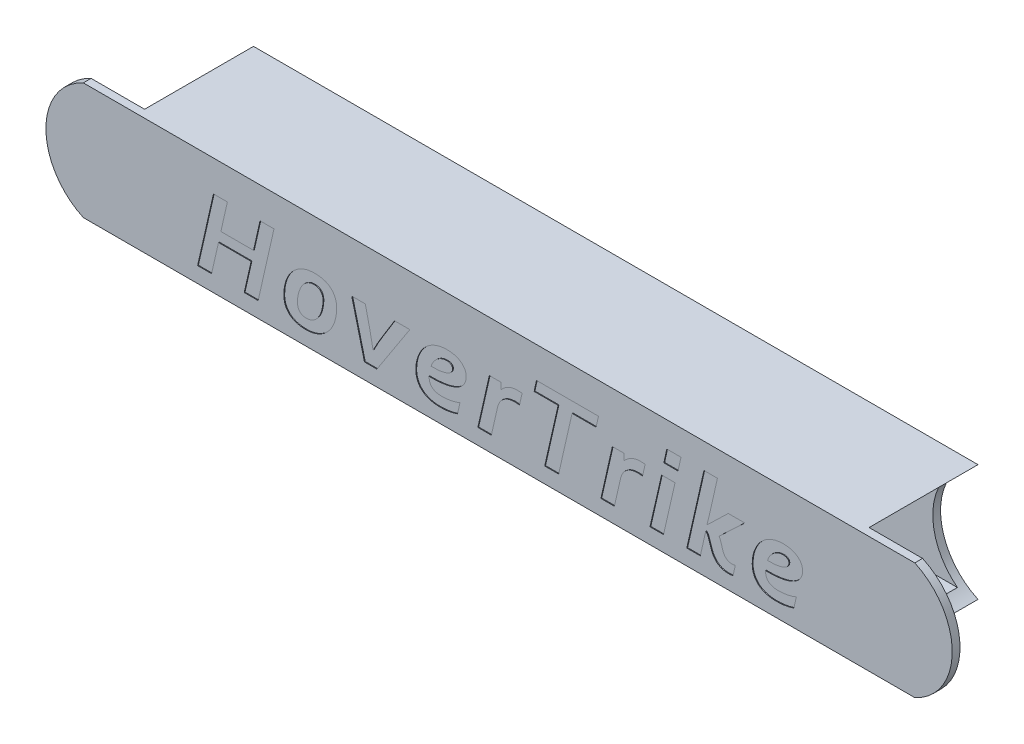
from build123d import *

# Parameters (mm, degrees)
ESQUISSE1_W             = 30
ESQUISSE1_H             = 30
ESQUISSE1_W_2           = 26
ESQUISSE1_H_2           = 26
BOSS_EXTRU_1_DEPTH      = 116.5
ENL_V_MAT_EXTRU_2_DEPTH = 124.98487811
ESQUISSE2_R             = 16.5
ENL_V_MAT_EXTRU_3_DEPTH = 28
ENL_V_MAT_EXTRU_4_DEPTH = 0.2


with BuildPart() as part:
    # Esquisse1 → Boss.-Extru.1 (new body)
    with BuildSketch(Plane(origin=(0, 0, 0), x_dir=(0, 0, -1), z_dir=(1, 0, 0))):
        with Locations((15, -15)):
            Rectangle(ESQUISSE1_W, ESQUISSE1_H)
        with Locations((15, -15)):
            Rectangle(ESQUISSE1_W_2, ESQUISSE1_H_2, mode=Mode.SUBTRACT)
    boss_extru_1 = extrude(amount=BOSS_EXTRU_1_DEPTH)

    # Esquisse3 → Enl_v. mat.-Extru.2 (cut, through all)
    with BuildSketch(Plane(origin=(0, 0, -30), x_dir=(-1, 0, 0), z_dir=(0, 0, -1))):
        with BuildLine():
            Line((-106.873863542, 0), (-116.5, 0))
            Line((-116.5, 0), (-126.126136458, 0))
            Line((-126.126136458, 0), (-126.126136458, -30))
            Line((-126.126136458, -30), (-116.5, -30))
            Line((-116.5, -30), (-106.873863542, -30))
            ThreePointArc((-106.873863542, -30), (-116.5, -15), (-106.873863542, 0))
        make_face()
    enl_v_mat_extru_2 = extrude(amount=-ENL_V_MAT_EXTRU_2_DEPTH, mode=Mode.SUBTRACT)

    # Esquisse2 → Enl_v. mat.-Extru.3 (cut)
    with BuildSketch(Plane(origin=(0, 0, -30), x_dir=(-1, 0, 0), z_dir=(0, 0, -1))):
        with Locations((-100, -15)):
            Circle(ESQUISSE2_R)
    enl_v_mat_extru_3 = extrude(amount=-ENL_V_MAT_EXTRU_3_DEPTH, mode=Mode.SUBTRACT)

    # Sym_trie1: Boss.-Extru.1, Enl_v. mat.-Extru.2, Enl_v. mat.-Extru.3 across plane
    add(boss_extru_1.mirror(Plane(origin=(0, 0, 0), x_dir=(0, 0, 1), z_dir=(1, 0, 0))))
    add(enl_v_mat_extru_2.mirror(Plane(origin=(0, 0, 0), x_dir=(0, 0, 1), z_dir=(1, 0, 0))), mode=Mode.SUBTRACT)
    add(enl_v_mat_extru_3.mirror(Plane(origin=(0, 0, 0), x_dir=(0, 0, 1), z_dir=(1, 0, 0))), mode=Mode.SUBTRACT)

    # Esquisse4 → Enl_v. mat.-Extru.4 (cut)
    # profile 1 of 11: a face of its own
    with BuildSketch(Plane.XY):
        Polygon((-71.513728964, -15.41364039), (-63.119574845, -15.41364039), (-61.445527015, -8), (-57.858281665, -8), (-61.931798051, -26), (-65.515057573, -26), (-63.737378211, -18.171833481), (-72.131532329, -18.171833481), (-73.909211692, -26), (-77.496457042, -26), (-73.422940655, -8), (-69.839681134, -8), align=None)
    # profile 2 of 11: a face of its own
    with BuildSketch(Plane.XY):
        with BuildLine():
            add(Edge.make_bspline(
                [(-47.307794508, -12.643489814), (-47.101761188, -12.647628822), (-46.699546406, -12.655708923), (-46.111356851, -12.709542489), (-45.555037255, -12.811226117), (-45.028430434, -12.945745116), (-44.53318254, -13.114646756), (-44.074907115, -13.327149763), (-43.655232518, -13.579855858), (-43.268742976, -13.866350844), (-42.925815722, -14.196175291), (-42.616155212, -14.561040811), (-42.360616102, -14.975039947), (-42.138885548, -15.42379312), (-41.962701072, -15.911256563), (-41.841364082, -16.438520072), (-41.762986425, -17.002957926), (-41.755438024, -17.39299219), (-41.751550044, -17.593888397)],
                knots=[0, 0, 0, 0, 1.169669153, 2.283408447, 3.348613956, 4.376697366, 5.366583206, 6.31478931, 7.23834747, 8.143426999, 9.039663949, 9.933899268, 10.852516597, 11.793616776, 12.77179613, 13.787129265, 14.860209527, 16, 16, 16, 16], degree=3))
            add(Edge.make_bspline(
                [(-41.751550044, -17.593888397), (-41.757670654, -17.878459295), (-41.769803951, -18.442583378), (-41.86723577, -19.280142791), (-42.033221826, -20.098619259), (-42.252482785, -20.897322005), (-42.538958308, -21.663825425), (-42.890344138, -22.386931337), (-43.303197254, -23.065585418), (-43.7770505, -23.695634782), (-44.311565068, -24.272968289), (-44.912497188, -24.786302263), (-45.572106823, -25.243186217), (-46.294515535, -25.63314324), (-47.075353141, -25.953447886), (-47.919915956, -26.172683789), (-48.821708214, -26.312736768), (-49.443652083, -26.327320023), (-49.763064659, -26.334809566)],
                knots=[0, 0, 0, 0, 1.026074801, 2.034057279, 3.03574541, 4.035495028, 5.0179998, 5.982309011, 6.930593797, 7.878333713, 8.820814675, 9.761991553, 10.7229142, 11.709115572, 12.717200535, 13.758554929, 14.848857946, 16, 16, 16, 16], degree=3))
            add(Edge.make_bspline(
                [(-49.763064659, -26.334809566), (-49.966467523, -26.330804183), (-50.364753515, -26.322961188), (-50.949644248, -26.266684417), (-51.506948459, -26.17252294), (-52.035277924, -26.037403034), (-52.530052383, -25.862190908), (-52.990584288, -25.650539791), (-53.41631003, -25.404288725), (-53.801292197, -25.115096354), (-54.147409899, -24.787771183), (-54.44576315, -24.41577366), (-54.713852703, -24.011840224), (-54.931149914, -23.561920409), (-55.108359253, -23.075168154), (-55.22986034, -22.54643775), (-55.307809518, -21.979308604), (-55.31540009, -21.586633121), (-55.319309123, -21.384410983)],
                knots=[0, 0, 0, 0, 1.154380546, 2.260408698, 3.331541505, 4.35943624, 5.351636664, 6.30651211, 7.232545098, 8.137458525, 9.033530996, 9.928619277, 10.838452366, 11.779379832, 12.757379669, 13.772526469, 14.852883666, 16, 16, 16, 16], degree=3))
            add(Edge.make_bspline(
                [(-55.319309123, -21.384410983), (-55.313193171, -21.099839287), (-55.301069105, -20.535713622), (-55.203569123, -19.698165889), (-55.038093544, -18.880900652), (-54.817897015, -18.081913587), (-54.527913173, -17.316316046), (-54.176777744, -16.591245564), (-53.764385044, -15.914500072), (-53.292925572, -15.284940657), (-52.757590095, -14.708470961), (-52.157345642, -14.192312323), (-51.494037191, -13.741046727), (-50.775886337, -13.347499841), (-49.99357002, -13.02946), (-49.150130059, -12.805299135), (-48.247789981, -12.665554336), (-47.627191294, -12.650987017), (-47.307794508, -12.643489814)],
                knots=[0, 0, 0, 0, 1.026343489, 2.034589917, 3.03654035, 4.031935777, 5.020872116, 5.985433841, 6.933966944, 7.875243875, 8.817971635, 9.766153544, 10.724611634, 11.706859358, 12.715208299, 13.762706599, 14.848556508, 16, 16, 16, 16], degree=3))
        make_face()
        with BuildLine():
            add(Edge.make_bspline(
                [(-47.602745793, -15.250221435), (-47.718474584, -15.253282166), (-47.945641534, -15.259290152), (-48.279042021, -15.306678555), (-48.5956764, -15.393098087), (-48.998017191, -15.53996309), (-49.468956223, -15.796988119), (-49.969609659, -16.205932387), (-50.408723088, -16.697029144), (-50.786694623, -17.25628838), (-51.098150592, -17.874452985), (-51.359877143, -18.529618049), (-51.567700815, -19.214955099), (-51.711885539, -19.915554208), (-51.804145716, -20.618001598), (-51.814581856, -21.085199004), (-51.819751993, -21.316651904)],
                knots=[0, 0, 0, 0, 0.594782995, 1.167514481, 1.725771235, 2.278908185, 3.366816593, 4.464328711, 5.586176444, 6.741632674, 7.923666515, 9.137317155, 10.364477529, 11.599404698, 12.810728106, 14, 14, 14, 14], degree=3))
            add(Edge.make_bspline(
                [(-51.819751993, -21.316651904), (-51.813788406, -21.494032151), (-51.802409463, -21.832486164), (-51.691447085, -22.31055396), (-51.518793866, -22.733216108), (-51.266336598, -23.093244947), (-50.936196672, -23.387983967), (-50.51366369, -23.584186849), (-50.01754985, -23.711102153), (-49.659014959, -23.72217971), (-49.468113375, -23.728077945)],
                knots=[0, 0, 0, 0, 1.104585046, 2.107626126, 3.043343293, 3.935332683, 4.827860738, 5.769138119, 6.812179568, 8, 8, 8, 8], degree=3))
            add(Edge.make_bspline(
                [(-49.468113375, -23.728077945), (-49.352348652, -23.725151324), (-49.125111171, -23.719406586), (-48.792551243, -23.670164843), (-48.475573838, -23.591150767), (-48.074484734, -23.439599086), (-47.603261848, -23.18257466), (-47.101317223, -22.771110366), (-46.658606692, -22.283447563), (-46.280881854, -21.723050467), (-45.958656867, -21.110823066), (-45.702029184, -20.451693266), (-45.503672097, -19.762532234), (-45.364262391, -19.055455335), (-45.265886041, -18.348607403), (-45.25597448, -17.877199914), (-45.251107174, -17.645704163)],
                knots=[0, 0, 0, 0, 0.593382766, 1.164765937, 1.719997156, 2.265443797, 3.360032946, 4.454961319, 5.578741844, 6.725846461, 7.911379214, 9.119658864, 10.346600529, 11.583921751, 12.81352787, 14, 14, 14, 14], degree=3))
            add(Edge.make_bspline(
                [(-45.251107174, -17.645704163), (-45.257272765, -17.471033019), (-45.269076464, -17.136634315), (-45.378316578, -16.662634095), (-45.557402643, -16.243888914), (-45.812341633, -15.885750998), (-46.143535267, -15.591133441), (-46.562293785, -15.388768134), (-47.058049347, -15.268843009), (-47.413335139, -15.25669683), (-47.602745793, -15.250221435)],
                knots=[0, 0, 0, 0, 1.093353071, 2.093166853, 3.029083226, 3.930240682, 4.827117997, 5.776676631, 6.814697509, 8, 8, 8, 8], degree=3))
        make_face(mode=Mode.SUBTRACT)
    # profile 3 of 11: a face of its own
    with BuildSketch(Plane.XY):
        with BuildLine():
            Line((-34.381753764, -12.966341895), (-33.249778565, -17.928697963))
            add(Edge.make_bspline(
                [(-33.249778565, -17.928697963), (-33.161901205, -18.311006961), (-32.990723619, -19.055712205), (-32.766234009, -20.147474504), (-32.562908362, -21.18029541), (-32.451070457, -21.851803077), (-32.396811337, -22.177590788)],
                knots=[0, 0, 0, 0, 1.085988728, 2.115413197, 3.085676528, 4, 4, 4, 4], degree=3))
            Line((-32.396811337, -22.177590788), (-32.309123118, -22.177590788))
            add(Edge.make_bspline(
                [(-32.309123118, -22.177590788), (-32.13052583, -21.824407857), (-31.772143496, -21.115693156), (-31.195789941, -20.071048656), (-30.599267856, -19.031484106), (-30.179813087, -18.35013481), (-29.969441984, -18.008414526)],
                knots=[0, 0, 0, 0, 0.992965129, 1.99253396, 2.993186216, 4, 4, 4, 4], degree=3))
            Line((-29.969441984, -18.008414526), (-26.856510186, -12.966341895))
            Line((-26.856510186, -12.966341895), (-22.930469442, -12.966341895))
            Line((-22.930469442, -12.966341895), (-31.41231178, -26))
            Line((-31.41231178, -26), (-34.600974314, -26))
            Line((-34.600974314, -26), (-37.877325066, -12.966341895))
            Line((-37.877325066, -12.966341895), (-34.381753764, -12.966341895))
        make_face()
    # profile 4 of 11: a face of its own
    with BuildSketch(Plane.XY):
        with BuildLine():
            add(Edge.make_bspline(
                [(-8.441984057, -16.206820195), (-8.448621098, -16.384089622), (-8.461673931, -16.732719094), (-8.573122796, -17.242489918), (-8.756718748, -17.723933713), (-9.017108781, -18.174258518), (-9.342240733, -18.597073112), (-9.741810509, -18.984170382), (-10.208157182, -19.339695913), (-10.741195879, -19.662883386), (-11.342716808, -19.948926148), (-12.011175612, -20.199131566), (-12.745783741, -20.412074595), (-13.544240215, -20.591711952), (-14.405961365, -20.727590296), (-15.329948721, -20.832973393), (-16.317228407, -20.891021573), (-16.996828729, -20.898354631), (-17.346324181, -20.902125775)],
                knots=[0, 0, 0, 0, 0.762492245, 1.499566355, 2.234662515, 2.972513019, 3.731047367, 4.523832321, 5.360138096, 6.25087119, 7.202584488, 8.223526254, 9.320384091, 10.492972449, 11.744594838, 13.07424482, 14.4953831, 16, 16, 16, 16], degree=3))
            add(Edge.make_bspline(
                [(-17.346324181, -20.902125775), (-17.440665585, -20.90121807), (-17.651993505, -20.899184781), (-17.863168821, -20.890815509), (-17.980070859, -20.886182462)],
                knots=[0, 0, 0, 0, 0.892843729, 2, 2, 2, 2], degree=3))
            Line((-17.980070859, -20.886182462), (-17.980070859, -20.969884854))
            add(Edge.make_bspline(
                [(-17.980070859, -20.969884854), (-17.976539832, -21.085573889), (-17.96974007, -21.308358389), (-17.9306934, -21.633259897), (-17.859679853, -21.933971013), (-17.760191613, -22.212751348), (-17.629864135, -22.465058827), (-17.481093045, -22.699049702), (-17.296805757, -22.902608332), (-17.095175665, -23.088111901), (-16.862650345, -23.244537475), (-16.60957322, -23.377888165), (-16.33405008, -23.492656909), (-15.926655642, -23.607841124), (-15.365925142, -23.707292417), (-14.902196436, -23.720944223), (-14.659875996, -23.728077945)],
                knots=[0, 0, 0, 0, 0.984919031, 1.896676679, 2.77993483, 3.609892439, 4.408996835, 5.193157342, 5.962333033, 6.739037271, 7.520092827, 8.33966102, 9.171311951, 10.055221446, 11.938664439, 14, 14, 14, 14], degree=3))
            add(Edge.make_bspline(
                [(-14.659875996, -23.728077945), (-14.46580435, -23.724941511), (-14.073106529, -23.718595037), (-13.477149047, -23.668214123), (-12.866703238, -23.588308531), (-12.250767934, -23.478495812), (-11.646541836, -23.341205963), (-11.074674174, -23.178268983), (-10.541344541, -22.996929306), (-10.206888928, -22.853276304), (-10.04428698, -22.78343667)],
                knots=[0, 0, 0, 0, 0.981983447, 1.987012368, 3.024442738, 4.096670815, 5.151921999, 6.158568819, 7.104753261, 8, 8, 8, 8], degree=3))
            Line((-10.04428698, -22.78343667), (-10.67404783, -25.581488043))
            add(Edge.make_bspline(
                [(-10.67404783, -25.581488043), (-10.83038373, -25.635971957), (-11.152697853, -25.748300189), (-11.656496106, -25.894630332), (-12.194220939, -26.02185095), (-12.760617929, -26.132184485), (-13.353162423, -26.225710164), (-13.966692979, -26.286624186), (-14.599477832, -26.329504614), (-15.027824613, -26.333020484), (-15.245792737, -26.334809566)],
                knots=[0, 0, 0, 0, 0.853176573, 1.758974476, 2.702351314, 3.700149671, 4.732523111, 5.792726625, 6.87680903, 8, 8, 8, 8], degree=3))
            add(Edge.make_bspline(
                [(-15.245792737, -26.334809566), (-15.499710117, -26.330393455), (-15.991352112, -26.321842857), (-16.703573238, -26.251278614), (-17.362810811, -26.126702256), (-17.972690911, -25.962341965), (-18.529438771, -25.74488433), (-19.036698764, -25.490215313), (-19.497400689, -25.199704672), (-19.901311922, -24.86139143), (-20.25726571, -24.489103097), (-20.568928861, -24.085006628), (-20.821145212, -23.642295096), (-21.037226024, -23.174691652), (-21.192569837, -22.673775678), (-21.30980987, -22.150200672), (-21.377637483, -21.601416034), (-21.387115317, -21.227815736), (-21.39193977, -21.037643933)],
                knots=[0, 0, 0, 0, 1.322631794, 2.560916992, 3.722922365, 4.814392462, 5.846510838, 6.830829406, 7.767772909, 8.677003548, 9.567952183, 10.446992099, 11.327828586, 12.216839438, 13.125226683, 14.053876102, 15.009374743, 16, 16, 16, 16], degree=3))
            add(Edge.make_bspline(
                [(-21.39193977, -21.037643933), (-21.380158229, -20.692806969), (-21.356535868, -20.001398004), (-21.203903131, -19.146557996), (-21.031013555, -18.474365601), (-20.868757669, -17.979370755), (-20.68920285, -17.492360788), (-20.471127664, -17.021317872), (-20.227781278, -16.56220335), (-19.959354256, -16.117773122), (-19.660111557, -15.692260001), (-19.340480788, -15.281808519), (-18.987909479, -14.895112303), (-18.611206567, -14.530772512), (-18.200949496, -14.201165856), (-17.7702304, -13.892279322), (-17.312399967, -13.61151557), (-16.823183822, -13.37094829), (-16.3119639, -13.1532299), (-15.773745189, -12.971094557), (-15.210001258, -12.820579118), (-14.620135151, -12.720761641), (-14.007772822, -12.653167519), (-13.591864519, -12.646751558), (-13.380425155, -12.643489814)],
                knots=[0, 0, 0, 0, 1.755336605, 3.519505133, 4.407325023, 5.288883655, 6.171065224, 7.049085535, 7.929864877, 8.816394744, 9.691071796, 10.5776533, 11.463795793, 12.353881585, 13.243633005, 14.141068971, 15.051972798, 15.974859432, 16.914825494, 17.879808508, 18.866117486, 19.882823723, 20.923670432, 22, 22, 22, 22], degree=3))
            add(Edge.make_bspline(
                [(-13.380425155, -12.643489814), (-13.195631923, -12.646327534), (-12.836024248, -12.651849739), (-12.310134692, -12.701255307), (-11.812925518, -12.77876141), (-11.344459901, -12.891657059), (-10.905598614, -13.029963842), (-10.497998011, -13.196250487), (-10.126140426, -13.392071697), (-9.788659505, -13.6126183), (-9.484676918, -13.855773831), (-9.213392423, -14.122800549), (-8.988235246, -14.421840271), (-8.788874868, -14.736554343), (-8.63457289, -15.075950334), (-8.519681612, -15.435253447), (-8.457599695, -15.815395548), (-8.447239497, -16.075086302), (-8.441984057, -16.206820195)],
                knots=[0, 0, 0, 0, 1.301366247, 2.532459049, 3.717147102, 4.843006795, 5.923292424, 6.955613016, 7.939366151, 8.878995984, 9.791003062, 10.677739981, 11.551893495, 12.421879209, 13.297084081, 14.170235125, 15.071811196, 16, 16, 16, 16], degree=3))
        make_face()
        with BuildLine():
            add(Edge.make_bspline(
                [(-11.937555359, -16.206820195), (-11.941962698, -16.134441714), (-11.950680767, -15.991271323), (-12.027072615, -15.786179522), (-12.15056258, -15.599492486), (-12.319770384, -15.43051371), (-12.540132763, -15.289021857), (-12.810998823, -15.186330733), (-13.132198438, -15.128296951), (-13.361575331, -15.122033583), (-13.484056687, -15.118689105)],
                knots=[0, 0, 0, 0, 0.819253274, 1.62054813, 2.448634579, 3.344255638, 4.314570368, 5.39823568, 6.610724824, 8, 8, 8, 8], degree=3))
            add(Edge.make_bspline(
                [(-13.484056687, -15.118689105), (-13.681733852, -15.128728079), (-14.088880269, -15.149404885), (-14.691863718, -15.321979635), (-15.284756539, -15.588626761), (-15.845087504, -15.961258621), (-16.354562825, -16.43893153), (-16.72748065, -16.907675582), (-16.998426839, -17.322149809), (-17.176294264, -17.663814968), (-17.338309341, -18.026145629), (-17.422897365, -18.281281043), (-17.465899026, -18.410983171)],
                knots=[0, 0, 0, 0, 1.073178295, 2.210375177, 3.383881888, 4.597949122, 5.850182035, 7.165553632, 7.844782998, 8.539506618, 9.257535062, 10, 10, 10, 10], degree=3))
            add(Edge.make_bspline(
                [(-17.465899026, -18.410983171), (-17.216053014, -18.409086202), (-16.737340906, -18.405451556), (-16.051568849, -18.36722908), (-15.428165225, -18.317205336), (-14.866698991, -18.228837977), (-14.359586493, -18.134606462), (-13.908255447, -18.009859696), (-13.503651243, -17.889459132), (-13.154609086, -17.739097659), (-12.852777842, -17.579872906), (-12.595198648, -17.410252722), (-12.38558951, -17.225417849), (-12.218863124, -17.032326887), (-12.093723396, -16.83109616), (-12.006158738, -16.625117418), (-11.94510833, -16.417572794), (-11.940045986, -16.276316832), (-11.937555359, -16.206820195)],
                knots=[0, 0, 0, 0, 1.856650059, 3.557394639, 5.104013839, 6.501915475, 7.780048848, 8.934525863, 9.98071473, 10.914263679, 11.753599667, 12.514964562, 13.200516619, 13.823865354, 14.404787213, 14.953246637, 15.485006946, 16, 16, 16, 16], degree=3))
        make_face(mode=Mode.SUBTRACT)
    # profile 5 of 11: a face of its own
    with BuildSketch(Plane.XY):
        with BuildLine():
            add(Edge.make_bspline(
                [(5.249335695, -15.69663419), (5.042729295, -15.656101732), (4.63988738, -15.577071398), (4.229556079, -15.566342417), (4.029672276, -15.561116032)],
                knots=[0, 0, 0, 0, 1.025744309, 2, 2, 2, 2], degree=3))
            add(Edge.make_bspline(
                [(4.029672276, -15.561116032), (3.851375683, -15.567031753), (3.490424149, -15.579007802), (2.950326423, -15.659919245), (2.411879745, -15.797191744), (1.889887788, -16.010269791), (1.38534902, -16.291783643), (0.908921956, -16.648893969), (0.476773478, -17.101302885), (0.251624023, -17.460481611), (0.135518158, -17.645704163)],
                knots=[0, 0, 0, 0, 0.923546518, 1.869668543, 2.822898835, 3.795536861, 4.781597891, 5.808513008, 6.869886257, 8, 8, 8, 8], degree=3))
            add(Edge.make_bspline(
                [(0.135518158, -17.645704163), (0.08104032, -17.748665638), (-0.036925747, -17.971617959), (-0.16654741, -18.275233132), (-0.264217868, -18.562534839), (-0.344255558, -18.821282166), (-0.423373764, -19.120593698), (-0.472317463, -19.334209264), (-0.498228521, -19.447298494)],
                knots=[0, 0, 0, 0, 1.093556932, 2.367983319, 3.093907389, 3.94231311, 4.910649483, 6, 6, 6, 6], degree=3))
            Line((-0.498228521, -19.447298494), (-1.980956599, -26))
            Line((-1.980956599, -26), (-5.452612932, -26))
            Line((-5.452612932, -26), (-2.495128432, -12.966341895))
            Line((-2.495128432, -12.966341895), (0.458370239, -12.966341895))
            Line((0.458370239, -12.966341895), (0.458370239, -14.604517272))
            Line((0.458370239, -14.604517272), (0.518157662, -14.604517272))
            add(Edge.make_bspline(
                [(0.518157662, -14.604517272), (0.658952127, -14.455595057), (0.936455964, -14.162071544), (1.394298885, -13.774977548), (1.874236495, -13.43818751), (2.380787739, -13.15052019), (2.922663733, -12.920793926), (3.507398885, -12.756317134), (4.136781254, -12.660764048), (4.571411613, -12.649356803), (4.794951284, -12.643489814)],
                knots=[0, 0, 0, 0, 1.011534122, 1.993718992, 2.95487779, 3.90388708, 4.865448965, 5.854209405, 6.896374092, 8, 8, 8, 8], degree=3))
            add(Edge.make_bspline(
                [(4.794951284, -12.643489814), (4.97983831, -12.647112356), (5.358497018, -12.654531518), (5.734509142, -12.699959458), (5.926926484, -12.723206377)],
                knots=[0, 0, 0, 0, 0.976536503, 2, 2, 2, 2], degree=3))
            Line((5.926926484, -12.723206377), (5.249335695, -15.69663419))
        make_face()
    # profile 6 of 11: a face of its own
    with BuildSketch(Plane.XY):
        Polygon((15.317537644, -26), (11.734278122, -26), (15.186005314, -10.758193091), (9.011957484, -10.758193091), (9.617803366, -8), (25.561116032, -8), (24.947298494, -10.758193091), (18.773250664, -10.758193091), align=None)
    # profile 7 of 11: a face of its own
    with BuildSketch(Plane.XY):
        with BuildLine():
            add(Edge.make_bspline(
                [(36.880868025, -15.69663419), (36.674261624, -15.656101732), (36.271419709, -15.577071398), (35.861088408, -15.566342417), (35.661204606, -15.561116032)],
                knots=[0, 0, 0, 0, 1.025744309, 2, 2, 2, 2], degree=3))
            add(Edge.make_bspline(
                [(35.661204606, -15.561116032), (35.482908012, -15.567031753), (35.121956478, -15.579007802), (34.581858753, -15.659919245), (34.043412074, -15.797191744), (33.521420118, -16.010269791), (33.016881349, -16.291783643), (32.540454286, -16.648893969), (32.108305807, -17.101302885), (31.883156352, -17.460481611), (31.767050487, -17.645704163)],
                knots=[0, 0, 0, 0, 0.923546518, 1.869668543, 2.822898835, 3.795536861, 4.781597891, 5.808513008, 6.869886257, 8, 8, 8, 8], degree=3))
            add(Edge.make_bspline(
                [(31.767050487, -17.645704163), (31.71257265, -17.748665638), (31.594606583, -17.971617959), (31.46498492, -18.275233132), (31.367314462, -18.562534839), (31.287276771, -18.821282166), (31.208158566, -19.120593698), (31.159214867, -19.334209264), (31.133303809, -19.447298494)],
                knots=[0, 0, 0, 0, 1.093556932, 2.367983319, 3.093907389, 3.94231311, 4.910649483, 6, 6, 6, 6], degree=3))
            Line((31.133303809, -19.447298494), (29.650575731, -26))
            Line((29.650575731, -26), (26.178919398, -26))
            Line((26.178919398, -26), (29.136403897, -12.966341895))
            Line((29.136403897, -12.966341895), (32.089902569, -12.966341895))
            Line((32.089902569, -12.966341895), (32.089902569, -14.604517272))
            Line((32.089902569, -14.604517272), (32.149689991, -14.604517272))
            add(Edge.make_bspline(
                [(32.149689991, -14.604517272), (32.290484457, -14.455595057), (32.567988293, -14.162071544), (33.025831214, -13.774977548), (33.505768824, -13.43818751), (34.012320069, -13.15052019), (34.554196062, -12.920793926), (35.138931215, -12.756317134), (35.768313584, -12.660764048), (36.202943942, -12.649356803), (36.426483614, -12.643489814)],
                knots=[0, 0, 0, 0, 1.011534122, 1.993718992, 2.95487779, 3.90388708, 4.865448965, 5.854209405, 6.896374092, 8, 8, 8, 8], degree=3))
            add(Edge.make_bspline(
                [(36.426483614, -12.643489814), (36.611370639, -12.647112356), (36.990029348, -12.654531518), (37.366041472, -12.699959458), (37.558458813, -12.723206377)],
                knots=[0, 0, 0, 0, 0.976536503, 2, 2, 2, 2], degree=3))
            Line((37.558458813, -12.723206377), (36.880868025, -15.69663419))
        make_face()
    # profile 8 of 11: a face of its own
    with BuildSketch(Plane.XY):
        Polygon((42.365367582, -9.976970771), (43.13064659, -6.52125775), (46.773693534, -6.52125775), (46.008414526, -9.976970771), align=None)
    # profile 9 of 11: a face of its own
    with BuildSketch(Plane.XY):
        Polygon((38.806023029, -26), (41.775465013, -12.966341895), (45.247121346, -12.966341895), (42.277679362, -26), align=None)
    # profile 10 of 11: a face of its own
    with BuildSketch(Plane.XY):
        with BuildLine():
            Line((51.736049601, -26), (48.264393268, -26))
            Line((48.264393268, -26), (52.676705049, -6.52125775))
            Line((52.676705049, -6.52125775), (56.144375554, -6.52125775))
            Line((56.144375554, -6.52125775), (53.984056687, -16.08724535))
            add(Edge.make_bspline(
                [(53.984056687, -16.08724535), (53.943403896, -16.2600957), (53.860403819, -16.613001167), (53.726243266, -17.138496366), (53.594112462, -17.656251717), (53.499740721, -17.99263925), (53.453941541, -18.155890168)],
                knots=[0, 0, 0, 0, 0.997697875, 2.036981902, 3.047335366, 4, 4, 4, 4], degree=3))
            Line((53.453941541, -18.155890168), (53.557573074, -18.155890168))
            Line((53.557573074, -18.155890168), (58.922497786, -12.966341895))
            Line((58.922497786, -12.966341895), (63.167404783, -12.966341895))
            Line((63.167404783, -12.966341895), (56.582816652, -19.192205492))
            Line((56.582816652, -19.192205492), (56.582816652, -19.248007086))
            add(Edge.make_bspline(
                [(56.582816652, -19.248007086), (56.654178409, -19.349051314), (56.80893162, -19.56817314), (56.944549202, -19.975150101), (57.077705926, -20.42487576), (57.207822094, -20.907558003), (57.355923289, -21.405069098), (57.514392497, -21.905501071), (57.716482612, -22.384320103), (57.979815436, -22.818643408), (58.314658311, -23.191111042), (58.652303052, -23.443424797), (58.965409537, -23.593838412), (59.234736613, -23.671347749), (59.531896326, -23.71997112), (59.739387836, -23.725305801), (59.84720992, -23.728077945)],
                knots=[0, 0, 0, 0, 0.860393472, 1.865826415, 2.970569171, 4.146696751, 5.35729505, 6.599501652, 7.814011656, 8.981491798, 10.132156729, 11.294899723, 11.901373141, 12.550698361, 13.246876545, 14, 14, 14, 14], degree=3))
            add(Edge.make_bspline(
                [(59.84720992, -23.728077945), (59.981742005, -23.721687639), (60.277931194, -23.707618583), (60.569139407, -23.65123447), (60.728077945, -23.620460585)],
                knots=[0, 0, 0, 0, 0.908419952, 2, 2, 2, 2], degree=3))
            Line((60.728077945, -23.620460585), (60.142161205, -26.243135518))
            add(Edge.make_bspline(
                [(60.142161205, -26.243135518), (59.95107478, -26.266379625), (59.580367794, -26.311473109), (59.207026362, -26.319138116), (59.026129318, -26.322852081)],
                knots=[0, 0, 0, 0, 1.030929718, 2, 2, 2, 2], degree=3))
            add(Edge.make_bspline(
                [(59.026129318, -26.322852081), (58.82259834, -26.318986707), (58.431266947, -26.311554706), (57.872791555, -26.235409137), (57.368518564, -26.112697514), (56.917009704, -25.943225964), (56.521291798, -25.718953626), (56.154120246, -25.484249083), (55.830497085, -25.209440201), (55.541492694, -24.910501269), (55.293717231, -24.584941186), (55.065993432, -24.249799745), (54.875566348, -23.893191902), (54.66196918, -23.400009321), (54.439142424, -22.779315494), (54.198102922, -22.052665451), (53.982127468, -21.368143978), (53.797612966, -20.83743999), (53.647167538, -20.453789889), (53.513488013, -20.212568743), (53.367868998, -20.003182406), (53.248702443, -19.891906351), (53.190876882, -19.837909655)],
                knots=[0, 0, 0, 0, 1.281680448, 2.464301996, 3.542318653, 4.546541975, 5.490487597, 6.402878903, 7.288142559, 8.158399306, 9.01735117, 9.862404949, 10.708825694, 11.559581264, 13.246639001, 14.861311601, 16.383396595, 17.767984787, 18.402217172, 18.975402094, 19.502813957, 20, 20, 20, 20], degree=3))
            Line((53.190876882, -19.837909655), (53.13108946, -19.837909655))
            Line((53.13108946, -19.837909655), (51.736049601, -26))
        make_face()
    # profile 11 of 11: a face of its own
    with BuildSketch(Plane.XY):
        with BuildLine():
            add(Edge.make_bspline(
                [(78.034543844, -16.206820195), (78.027906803, -16.384089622), (78.014853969, -16.732719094), (77.903405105, -17.242489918), (77.719809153, -17.723933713), (77.45941912, -18.174258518), (77.134287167, -18.597073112), (76.734717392, -18.984170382), (76.268370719, -19.339695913), (75.735332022, -19.662883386), (75.133811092, -19.948926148), (74.465352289, -20.199131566), (73.73074416, -20.412074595), (72.932287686, -20.591711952), (72.070566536, -20.727590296), (71.14657918, -20.832973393), (70.159299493, -20.891021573), (69.479699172, -20.898354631), (69.13020372, -20.902125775)],
                knots=[0, 0, 0, 0, 0.762492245, 1.499566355, 2.234662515, 2.972513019, 3.731047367, 4.523832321, 5.360138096, 6.25087119, 7.202584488, 8.223526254, 9.320384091, 10.492972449, 11.744594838, 13.07424482, 14.4953831, 16, 16, 16, 16], degree=3))
            add(Edge.make_bspline(
                [(69.13020372, -20.902125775), (69.035862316, -20.90121807), (68.824534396, -20.899184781), (68.613359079, -20.890815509), (68.496457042, -20.886182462)],
                knots=[0, 0, 0, 0, 0.892843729, 2, 2, 2, 2], degree=3))
            Line((68.496457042, -20.886182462), (68.496457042, -20.969884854))
            add(Edge.make_bspline(
                [(68.496457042, -20.969884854), (68.499988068, -21.085573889), (68.506787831, -21.308358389), (68.5458345, -21.633259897), (68.616848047, -21.933971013), (68.716336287, -22.212751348), (68.846663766, -22.465058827), (68.995434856, -22.699049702), (69.179722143, -22.902608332), (69.381352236, -23.088111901), (69.613877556, -23.244537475), (69.866954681, -23.377888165), (70.142477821, -23.492656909), (70.549872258, -23.607841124), (71.110602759, -23.707292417), (71.574331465, -23.720944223), (71.816651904, -23.728077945)],
                knots=[0, 0, 0, 0, 0.984919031, 1.896676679, 2.77993483, 3.609892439, 4.408996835, 5.193157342, 5.962333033, 6.739037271, 7.520092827, 8.33966102, 9.171311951, 10.055221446, 11.938664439, 14, 14, 14, 14], degree=3))
            add(Edge.make_bspline(
                [(71.816651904, -23.728077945), (72.01072355, -23.724941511), (72.403421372, -23.718595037), (72.999378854, -23.668214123), (73.609824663, -23.588308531), (74.225759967, -23.478495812), (74.829986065, -23.341205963), (75.401853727, -23.178268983), (75.93518336, -22.996929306), (76.269638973, -22.853276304), (76.432240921, -22.78343667)],
                knots=[0, 0, 0, 0, 0.981983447, 1.987012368, 3.024442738, 4.096670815, 5.151921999, 6.158568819, 7.104753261, 8, 8, 8, 8], degree=3))
            Line((76.432240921, -22.78343667), (75.802480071, -25.581488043))
            add(Edge.make_bspline(
                [(75.802480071, -25.581488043), (75.646144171, -25.635971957), (75.323830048, -25.748300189), (74.820031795, -25.894630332), (74.282306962, -26.02185095), (73.715909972, -26.132184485), (73.123365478, -26.225710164), (72.509834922, -26.286624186), (71.877050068, -26.329504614), (71.448703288, -26.333020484), (71.230735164, -26.334809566)],
                knots=[0, 0, 0, 0, 0.853176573, 1.758974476, 2.702351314, 3.700149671, 4.732523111, 5.792726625, 6.87680903, 8, 8, 8, 8], degree=3))
            add(Edge.make_bspline(
                [(71.230735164, -26.334809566), (70.976817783, -26.330393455), (70.485175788, -26.321842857), (69.772954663, -26.251278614), (69.113717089, -26.126702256), (68.50383699, -25.962341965), (67.947089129, -25.74488433), (67.439829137, -25.490215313), (66.979127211, -25.199704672), (66.575215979, -24.86139143), (66.219262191, -24.489103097), (65.907599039, -24.085006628), (65.655382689, -23.642295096), (65.439301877, -23.174691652), (65.283958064, -22.673775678), (65.166718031, -22.150200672), (65.098890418, -21.601416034), (65.089412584, -21.227815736), (65.084588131, -21.037643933)],
                knots=[0, 0, 0, 0, 1.322631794, 2.560916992, 3.722922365, 4.814392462, 5.846510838, 6.830829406, 7.767772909, 8.677003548, 9.567952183, 10.446992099, 11.327828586, 12.216839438, 13.125226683, 14.053876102, 15.009374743, 16, 16, 16, 16], degree=3))
            add(Edge.make_bspline(
                [(65.084588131, -21.037643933), (65.096369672, -20.692806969), (65.119992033, -20.001398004), (65.272624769, -19.146557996), (65.445514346, -18.474365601), (65.607770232, -17.979370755), (65.78732505, -17.492360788), (66.005400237, -17.021317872), (66.248746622, -16.56220335), (66.517173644, -16.117773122), (66.816416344, -15.692260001), (67.136047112, -15.281808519), (67.488618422, -14.895112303), (67.865321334, -14.530772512), (68.275578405, -14.201165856), (68.706297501, -13.892279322), (69.164127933, -13.61151557), (69.653344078, -13.37094829), (70.164564, -13.1532299), (70.702782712, -12.971094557), (71.266526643, -12.820579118), (71.85639275, -12.720761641), (72.468755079, -12.653167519), (72.884663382, -12.646751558), (73.096102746, -12.643489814)],
                knots=[0, 0, 0, 0, 1.755336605, 3.519505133, 4.407325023, 5.288883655, 6.171065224, 7.049085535, 7.929864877, 8.816394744, 9.691071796, 10.5776533, 11.463795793, 12.353881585, 13.243633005, 14.141068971, 15.051972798, 15.974859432, 16.914825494, 17.879808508, 18.866117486, 19.882823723, 20.923670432, 22, 22, 22, 22], degree=3))
            add(Edge.make_bspline(
                [(73.096102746, -12.643489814), (73.280895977, -12.646327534), (73.640503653, -12.651849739), (74.166393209, -12.701255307), (74.663602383, -12.77876141), (75.132068, -12.891657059), (75.570929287, -13.029963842), (75.97852989, -13.196250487), (76.350387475, -13.392071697), (76.687868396, -13.6126183), (76.991850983, -13.855773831), (77.263135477, -14.122800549), (77.488292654, -14.421840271), (77.687653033, -14.736554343), (77.84195501, -15.075950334), (77.956846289, -15.435253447), (78.018928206, -15.815395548), (78.029288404, -16.075086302), (78.034543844, -16.206820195)],
                knots=[0, 0, 0, 0, 1.301366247, 2.532459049, 3.717147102, 4.843006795, 5.923292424, 6.955613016, 7.939366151, 8.878995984, 9.791003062, 10.677739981, 11.551893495, 12.421879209, 13.297084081, 14.170235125, 15.071811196, 16, 16, 16, 16], degree=3))
        make_face()
        with BuildLine():
            add(Edge.make_bspline(
                [(74.538972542, -16.206820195), (74.534565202, -16.134441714), (74.525847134, -15.991271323), (74.449455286, -15.786179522), (74.325965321, -15.599492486), (74.156757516, -15.43051371), (73.936395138, -15.289021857), (73.665529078, -15.186330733), (73.344329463, -15.128296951), (73.11495257, -15.122033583), (72.992471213, -15.118689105)],
                knots=[0, 0, 0, 0, 0.819253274, 1.62054813, 2.448634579, 3.344255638, 4.314570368, 5.39823568, 6.610724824, 8, 8, 8, 8], degree=3))
            add(Edge.make_bspline(
                [(72.992471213, -15.118689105), (72.794794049, -15.128728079), (72.387647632, -15.149404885), (71.784664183, -15.321979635), (71.191771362, -15.588626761), (70.631440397, -15.961258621), (70.121965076, -16.43893153), (69.749047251, -16.907675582), (69.478101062, -17.322149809), (69.300233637, -17.663814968), (69.138218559, -18.026145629), (69.053630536, -18.281281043), (69.010628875, -18.410983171)],
                knots=[0, 0, 0, 0, 1.073178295, 2.210375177, 3.383881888, 4.597949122, 5.850182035, 7.165553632, 7.844782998, 8.539506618, 9.257535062, 10, 10, 10, 10], degree=3))
            add(Edge.make_bspline(
                [(69.010628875, -18.410983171), (69.260474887, -18.409086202), (69.739186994, -18.405451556), (70.424959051, -18.36722908), (71.048362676, -18.317205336), (71.60982891, -18.228837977), (72.116941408, -18.134606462), (72.568272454, -18.009859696), (72.972876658, -17.889459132), (73.321918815, -17.739097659), (73.623750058, -17.579872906), (73.881329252, -17.410252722), (74.090938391, -17.225417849), (74.257664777, -17.032326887), (74.382804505, -16.83109616), (74.470369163, -16.625117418), (74.531419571, -16.417572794), (74.536481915, -16.276316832), (74.538972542, -16.206820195)],
                knots=[0, 0, 0, 0, 1.856650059, 3.557394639, 5.104013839, 6.501915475, 7.780048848, 8.934525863, 9.98071473, 10.914263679, 11.753599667, 12.514964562, 13.200516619, 13.823865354, 14.404787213, 14.953246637, 15.485006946, 16, 16, 16, 16], degree=3))
        make_face(mode=Mode.SUBTRACT)
    extrude(amount=-ENL_V_MAT_EXTRU_4_DEPTH, mode=Mode.SUBTRACT)


solid = part.part
